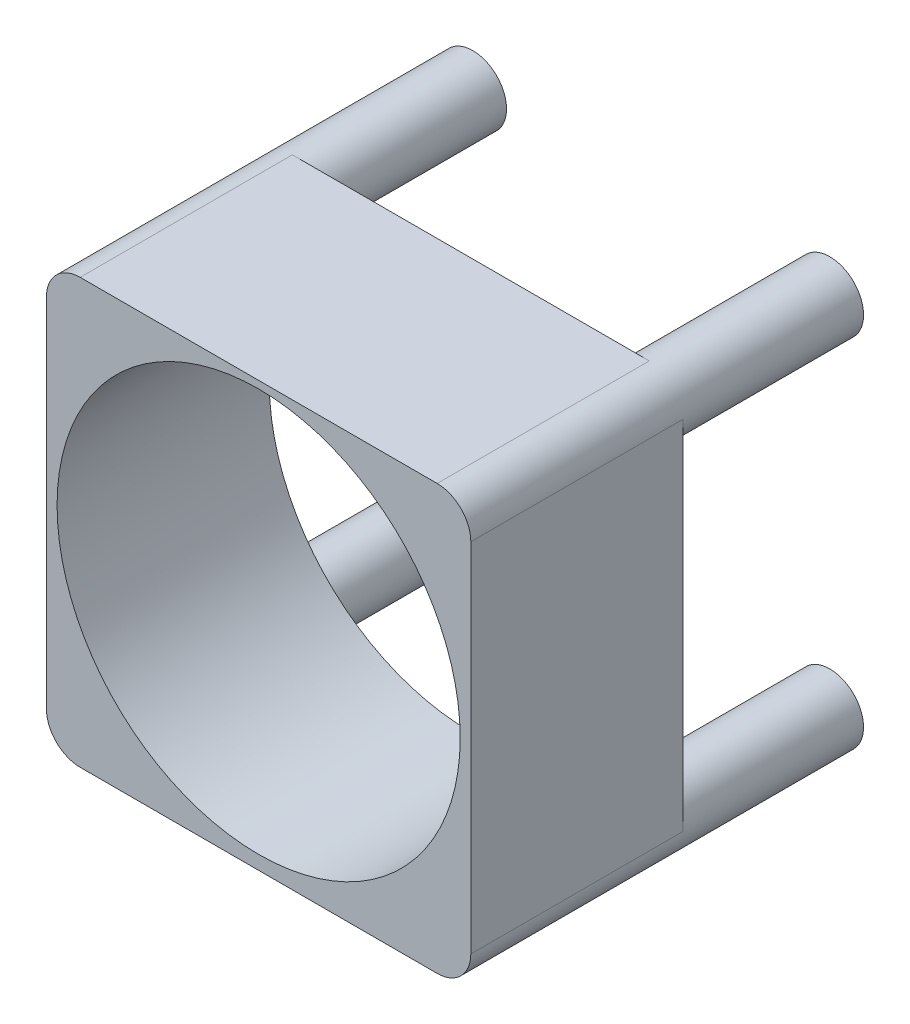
ISO-10303-21;
HEADER;
FILE_DESCRIPTION(('STEP AP214'),'2;1');
FILE_NAME('part.step','',(''),(''),'','','');
FILE_SCHEMA(('AUTOMOTIVE_DESIGN { 1 0 10303 214 1 1 1 1 }'));
ENDSEC;
DATA;
#1=APPLICATION_CONTEXT('core data for automotive mechanical design processes');
#2=APPLICATION_PROTOCOL_DEFINITION('international standard','automotive_design',2000,#1);
#3=PRODUCT_CONTEXT('',#1,'mechanical');
#4=PRODUCT('Part','Part','',(#3));
#5=PRODUCT_RELATED_PRODUCT_CATEGORY('part','',(#4));
#6=PRODUCT_DEFINITION_FORMATION('','',#4);
#7=PRODUCT_DEFINITION_CONTEXT('part definition',#1,'design');
#8=PRODUCT_DEFINITION('design','',#6,#7);
#9=PRODUCT_DEFINITION_SHAPE('','',#8);
#10=(LENGTH_UNIT() NAMED_UNIT(*) SI_UNIT(.MILLI.,.METRE.));
#11=(NAMED_UNIT(*) PLANE_ANGLE_UNIT() SI_UNIT($,.RADIAN.));
#12=(NAMED_UNIT(*) SI_UNIT($,.STERADIAN.) SOLID_ANGLE_UNIT());
#13=UNCERTAINTY_MEASURE_WITH_UNIT(LENGTH_MEASURE(1.E-05),#10,'distance_accuracy_value','');
#14=(GEOMETRIC_REPRESENTATION_CONTEXT(3) GLOBAL_UNCERTAINTY_ASSIGNED_CONTEXT((#13)) GLOBAL_UNIT_ASSIGNED_CONTEXT((#10,
#11,#12)) REPRESENTATION_CONTEXT('',''));
#15=CARTESIAN_POINT('',(0.,0.,0.));
#16=DIRECTION('',(0.,0.,1.));
#17=DIRECTION('',(1.,0.,0.));
#18=AXIS2_PLACEMENT_3D('',#15,#16,#17);
#19=CARTESIAN_POINT('',(3.175,3.175,0.));
#20=DIRECTION('',(0.,0.,1.));
#21=DIRECTION('',(1.,0.,0.));
#22=AXIS2_PLACEMENT_3D('',#19,#20,#21);
#23=PLANE('',#22);
#24=CARTESIAN_POINT('',(20.,20.3026372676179,0.));
#25=DIRECTION('',(0.,0.,1.));
#26=DIRECTION('',(1.,0.,0.));
#27=AXIS2_PLACEMENT_3D('',#24,#25,#26);
#28=CIRCLE('',#27,19.);
#29=CARTESIAN_POINT('',(39.,20.3026372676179,0.));
#30=VERTEX_POINT('',#29);
#31=EDGE_CURVE('E114',#30,#30,#28,.T.);
#32=ORIENTED_EDGE('',*,*,#31,.T.);
#33=EDGE_LOOP('',(#32));
#34=FACE_BOUND('',#33,.T.);
#35=CARTESIAN_POINT('',(36.825,3.17499999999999,0.));
#36=DIRECTION('',(0.,0.,-1.));
#37=DIRECTION('',(-1.,0.,0.));
#38=AXIS2_PLACEMENT_3D('',#35,#36,#37);
#39=CIRCLE('',#38,3.175);
#40=CARTESIAN_POINT('',(36.825,0.,0.));
#41=VERTEX_POINT('',#40);
#42=CARTESIAN_POINT('',(40.,3.17500000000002,0.));
#43=VERTEX_POINT('',#42);
#44=EDGE_CURVE('E96',#41,#43,#39,.T.);
#45=ORIENTED_EDGE('',*,*,#44,.F.);
#46=DIRECTION('',(1.,0.,0.));
#47=VECTOR('',#46,1.);
#48=CARTESIAN_POINT('',(3.17500000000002,0.,0.));
#49=LINE('',#48,#47);
#50=CARTESIAN_POINT('',(3.17500000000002,0.,0.));
#51=VERTEX_POINT('',#50);
#52=EDGE_CURVE('E98',#51,#41,#49,.T.);
#53=ORIENTED_EDGE('',*,*,#52,.F.);
#54=CARTESIAN_POINT('',(3.17499999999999,3.175,0.));
#55=DIRECTION('',(0.,0.,-1.));
#56=DIRECTION('',(1.,0.,0.));
#57=AXIS2_PLACEMENT_3D('',#54,#55,#56);
#58=CIRCLE('',#57,3.175);
#59=CARTESIAN_POINT('',(0.,3.175,0.));
#60=VERTEX_POINT('',#59);
#61=EDGE_CURVE('E190',#60,#51,#58,.T.);
#62=ORIENTED_EDGE('',*,*,#61,.F.);
#63=DIRECTION('',(0.,-1.,0.));
#64=VECTOR('',#63,1.);
#65=CARTESIAN_POINT('',(0.,3.17500000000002,0.));
#66=LINE('',#65,#64);
#67=CARTESIAN_POINT('',(0.,36.825,0.));
#68=VERTEX_POINT('',#67);
#69=EDGE_CURVE('E128',#68,#60,#66,.T.);
#70=ORIENTED_EDGE('',*,*,#69,.F.);
#71=CARTESIAN_POINT('',(3.175,36.825,0.));
#72=DIRECTION('',(0.,0.,-1.));
#73=DIRECTION('',(-1.,0.,0.));
#74=AXIS2_PLACEMENT_3D('',#71,#72,#73);
#75=CIRCLE('',#74,3.175);
#76=CARTESIAN_POINT('',(3.17500000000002,40.,0.));
#77=VERTEX_POINT('',#76);
#78=EDGE_CURVE('E11',#77,#68,#75,.T.);
#79=ORIENTED_EDGE('',*,*,#78,.F.);
#80=DIRECTION('',(-1.,0.,0.));
#81=VECTOR('',#80,1.);
#82=CARTESIAN_POINT('',(3.17500000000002,40.,0.));
#83=LINE('',#82,#81);
#84=CARTESIAN_POINT('',(36.825,40.,0.));
#85=VERTEX_POINT('',#84);
#86=EDGE_CURVE('E134',#85,#77,#83,.T.);
#87=ORIENTED_EDGE('',*,*,#86,.F.);
#88=CARTESIAN_POINT('',(36.825,36.825,0.));
#89=DIRECTION('',(0.,0.,-1.));
#90=DIRECTION('',(1.,0.,0.));
#91=AXIS2_PLACEMENT_3D('',#88,#89,#90);
#92=CIRCLE('',#91,3.175);
#93=CARTESIAN_POINT('',(40.,36.825,0.));
#94=VERTEX_POINT('',#93);
#95=EDGE_CURVE('E164',#94,#85,#92,.T.);
#96=ORIENTED_EDGE('',*,*,#95,.F.);
#97=DIRECTION('',(0.,1.,0.));
#98=VECTOR('',#97,1.);
#99=CARTESIAN_POINT('',(40.,3.17500000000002,0.));
#100=LINE('',#99,#98);
#101=EDGE_CURVE('E101',#43,#94,#100,.T.);
#102=ORIENTED_EDGE('',*,*,#101,.F.);
#103=EDGE_LOOP('',(#45,#53,#62,#70,#79,#87,#96,#102));
#104=FACE_BOUND('',#103,.T.);
#105=ADVANCED_FACE('F29',(#34,#104),#23,.F.);
#106=CARTESIAN_POINT('',(3.175,3.175,20.));
#107=DIRECTION('',(0.,0.,-1.));
#108=DIRECTION('',(-1.,0.,0.));
#109=AXIS2_PLACEMENT_3D('',#106,#107,#108);
#110=CYLINDRICAL_SURFACE('',#109,3.175);
#111=DIRECTION('',(0.,0.,-1.));
#112=VECTOR('',#111,1.);
#113=CARTESIAN_POINT('',(0.,3.17500000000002,20.));
#114=LINE('',#113,#112);
#115=CARTESIAN_POINT('',(0.,3.17500000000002,20.));
#116=VERTEX_POINT('',#115);
#117=EDGE_CURVE('E147',#116,#60,#114,.T.);
#118=ORIENTED_EDGE('',*,*,#117,.T.);
#119=ORIENTED_EDGE('',*,*,#61,.T.);
#120=DIRECTION('',(0.,0.,-1.));
#121=VECTOR('',#120,1.);
#122=CARTESIAN_POINT('',(3.17500000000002,0.,20.));
#123=LINE('',#122,#121);
#124=CARTESIAN_POINT('',(3.17500000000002,0.,20.));
#125=VERTEX_POINT('',#124);
#126=EDGE_CURVE('E38',#125,#51,#123,.T.);
#127=ORIENTED_EDGE('',*,*,#126,.F.);
#128=CARTESIAN_POINT('',(3.175,3.175,20.));
#129=DIRECTION('',(0.,0.,1.));
#130=DIRECTION('',(1.,0.,0.));
#131=AXIS2_PLACEMENT_3D('',#128,#129,#130);
#132=CIRCLE('',#131,3.175);
#133=EDGE_CURVE('E173',#116,#125,#132,.T.);
#134=ORIENTED_EDGE('',*,*,#133,.F.);
#135=EDGE_LOOP('',(#118,#119,#127,#134));
#136=FACE_BOUND('',#135,.T.);
#137=CARTESIAN_POINT('',(3.17499999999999,3.175,-17.018));
#138=DIRECTION('',(0.,0.,-1.));
#139=DIRECTION('',(1.,0.,0.));
#140=AXIS2_PLACEMENT_3D('',#137,#138,#139);
#141=CIRCLE('',#140,3.175);
#142=CARTESIAN_POINT('',(6.34999999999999,3.175,-17.018));
#143=VERTEX_POINT('',#142);
#144=EDGE_CURVE('E191',#143,#143,#141,.T.);
#145=ORIENTED_EDGE('',*,*,#144,.F.);
#146=EDGE_LOOP('',(#145));
#147=FACE_BOUND('',#146,.T.);
#148=ADVANCED_FACE('F31',(#136,#147),#110,.T.);
#149=CARTESIAN_POINT('',(3.17500000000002,0.,20.));
#150=DIRECTION('',(0.,1.,0.));
#151=DIRECTION('',(0.,0.,1.));
#152=AXIS2_PLACEMENT_3D('',#149,#150,#151);
#153=PLANE('',#152);
#154=ORIENTED_EDGE('',*,*,#52,.T.);
#155=DIRECTION('',(0.,0.,-1.));
#156=VECTOR('',#155,1.);
#157=CARTESIAN_POINT('',(36.825,0.,20.));
#158=LINE('',#157,#156);
#159=CARTESIAN_POINT('',(36.825,0.,20.));
#160=VERTEX_POINT('',#159);
#161=EDGE_CURVE('E111',#160,#41,#158,.T.);
#162=ORIENTED_EDGE('',*,*,#161,.F.);
#163=DIRECTION('',(1.,0.,0.));
#164=VECTOR('',#163,1.);
#165=CARTESIAN_POINT('',(3.17500000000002,0.,20.));
#166=LINE('',#165,#164);
#167=EDGE_CURVE('E175',#125,#160,#166,.T.);
#168=ORIENTED_EDGE('',*,*,#167,.F.);
#169=ORIENTED_EDGE('',*,*,#126,.T.);
#170=EDGE_LOOP('',(#154,#162,#168,#169));
#171=FACE_BOUND('',#170,.T.);
#172=ADVANCED_FACE('F110',(#171),#153,.F.);
#173=CARTESIAN_POINT('',(36.825,3.175,20.));
#174=DIRECTION('',(0.,0.,-1.));
#175=DIRECTION('',(-1.,0.,0.));
#176=AXIS2_PLACEMENT_3D('',#173,#174,#175);
#177=CYLINDRICAL_SURFACE('',#176,3.175);
#178=ORIENTED_EDGE('',*,*,#161,.T.);
#179=ORIENTED_EDGE('',*,*,#44,.T.);
#180=DIRECTION('',(0.,0.,-1.));
#181=VECTOR('',#180,1.);
#182=CARTESIAN_POINT('',(40.,3.17500000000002,20.));
#183=LINE('',#182,#181);
#184=CARTESIAN_POINT('',(40.,3.17500000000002,20.));
#185=VERTEX_POINT('',#184);
#186=EDGE_CURVE('E119',#185,#43,#183,.T.);
#187=ORIENTED_EDGE('',*,*,#186,.F.);
#188=CARTESIAN_POINT('',(36.825,3.175,20.));
#189=DIRECTION('',(0.,0.,1.));
#190=DIRECTION('',(1.,0.,0.));
#191=AXIS2_PLACEMENT_3D('',#188,#189,#190);
#192=CIRCLE('',#191,3.175);
#193=EDGE_CURVE('E118',#160,#185,#192,.T.);
#194=ORIENTED_EDGE('',*,*,#193,.F.);
#195=EDGE_LOOP('',(#178,#179,#187,#194));
#196=FACE_BOUND('',#195,.T.);
#197=CARTESIAN_POINT('',(36.825,3.17499999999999,-17.018));
#198=DIRECTION('',(0.,0.,-1.));
#199=DIRECTION('',(-1.,0.,0.));
#200=AXIS2_PLACEMENT_3D('',#197,#198,#199);
#201=CIRCLE('',#200,3.175);
#202=CARTESIAN_POINT('',(33.65,3.17499999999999,-17.018));
#203=VERTEX_POINT('',#202);
#204=EDGE_CURVE('E106',#203,#203,#201,.T.);
#205=ORIENTED_EDGE('',*,*,#204,.F.);
#206=EDGE_LOOP('',(#205));
#207=FACE_BOUND('',#206,.T.);
#208=ADVANCED_FACE('F116',(#196,#207),#177,.T.);
#209=CARTESIAN_POINT('',(40.,3.17500000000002,20.));
#210=DIRECTION('',(-1.,0.,0.));
#211=DIRECTION('',(0.,0.,1.));
#212=AXIS2_PLACEMENT_3D('',#209,#210,#211);
#213=PLANE('',#212);
#214=ORIENTED_EDGE('',*,*,#101,.T.);
#215=DIRECTION('',(0.,0.,-1.));
#216=VECTOR('',#215,1.);
#217=CARTESIAN_POINT('',(40.,36.825,20.));
#218=LINE('',#217,#216);
#219=CARTESIAN_POINT('',(40.,36.825,20.));
#220=VERTEX_POINT('',#219);
#221=EDGE_CURVE('E122',#220,#94,#218,.T.);
#222=ORIENTED_EDGE('',*,*,#221,.F.);
#223=DIRECTION('',(0.,1.,0.));
#224=VECTOR('',#223,1.);
#225=CARTESIAN_POINT('',(40.,3.17500000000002,20.));
#226=LINE('',#225,#224);
#227=EDGE_CURVE('E169',#185,#220,#226,.T.);
#228=ORIENTED_EDGE('',*,*,#227,.F.);
#229=ORIENTED_EDGE('',*,*,#186,.T.);
#230=EDGE_LOOP('',(#214,#222,#228,#229));
#231=FACE_BOUND('',#230,.T.);
#232=ADVANCED_FACE('F168',(#231),#213,.F.);
#233=CARTESIAN_POINT('',(36.825,36.825,20.));
#234=DIRECTION('',(0.,0.,-1.));
#235=DIRECTION('',(-1.,0.,0.));
#236=AXIS2_PLACEMENT_3D('',#233,#234,#235);
#237=CYLINDRICAL_SURFACE('',#236,3.175);
#238=ORIENTED_EDGE('',*,*,#221,.T.);
#239=ORIENTED_EDGE('',*,*,#95,.T.);
#240=DIRECTION('',(0.,0.,-1.));
#241=VECTOR('',#240,1.);
#242=CARTESIAN_POINT('',(36.825,40.,20.));
#243=LINE('',#242,#241);
#244=CARTESIAN_POINT('',(36.825,40.,20.));
#245=VERTEX_POINT('',#244);
#246=EDGE_CURVE('E140',#245,#85,#243,.T.);
#247=ORIENTED_EDGE('',*,*,#246,.F.);
#248=CARTESIAN_POINT('',(36.825,36.825,20.));
#249=DIRECTION('',(0.,0.,1.));
#250=DIRECTION('',(1.,0.,0.));
#251=AXIS2_PLACEMENT_3D('',#248,#249,#250);
#252=CIRCLE('',#251,3.175);
#253=EDGE_CURVE('E165',#220,#245,#252,.T.);
#254=ORIENTED_EDGE('',*,*,#253,.F.);
#255=EDGE_LOOP('',(#238,#239,#247,#254));
#256=FACE_BOUND('',#255,.T.);
#257=CARTESIAN_POINT('',(36.825,36.825,-17.018));
#258=DIRECTION('',(0.,0.,-1.));
#259=DIRECTION('',(1.,0.,0.));
#260=AXIS2_PLACEMENT_3D('',#257,#258,#259);
#261=CIRCLE('',#260,3.175);
#262=CARTESIAN_POINT('',(40.,36.825,-17.018));
#263=VERTEX_POINT('',#262);
#264=EDGE_CURVE('E199',#263,#263,#261,.T.);
#265=ORIENTED_EDGE('',*,*,#264,.F.);
#266=EDGE_LOOP('',(#265));
#267=FACE_BOUND('',#266,.T.);
#268=ADVANCED_FACE('F161',(#256,#267),#237,.T.);
#269=CARTESIAN_POINT('',(3.17500000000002,40.,20.));
#270=DIRECTION('',(0.,-1.,0.));
#271=DIRECTION('',(0.,0.,-1.));
#272=AXIS2_PLACEMENT_3D('',#269,#270,#271);
#273=PLANE('',#272);
#274=ORIENTED_EDGE('',*,*,#86,.T.);
#275=DIRECTION('',(0.,0.,-1.));
#276=VECTOR('',#275,1.);
#277=CARTESIAN_POINT('',(3.17500000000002,40.,20.));
#278=LINE('',#277,#276);
#279=CARTESIAN_POINT('',(3.17500000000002,40.,20.));
#280=VERTEX_POINT('',#279);
#281=EDGE_CURVE('E138',#280,#77,#278,.T.);
#282=ORIENTED_EDGE('',*,*,#281,.F.);
#283=DIRECTION('',(-1.,0.,0.));
#284=VECTOR('',#283,1.);
#285=CARTESIAN_POINT('',(3.17500000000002,40.,20.));
#286=LINE('',#285,#284);
#287=EDGE_CURVE('E180',#245,#280,#286,.T.);
#288=ORIENTED_EDGE('',*,*,#287,.F.);
#289=ORIENTED_EDGE('',*,*,#246,.T.);
#290=EDGE_LOOP('',(#274,#282,#288,#289));
#291=FACE_BOUND('',#290,.T.);
#292=ADVANCED_FACE('F184',(#291),#273,.F.);
#293=CARTESIAN_POINT('',(3.175,36.825,20.));
#294=DIRECTION('',(0.,0.,-1.));
#295=DIRECTION('',(-1.,0.,0.));
#296=AXIS2_PLACEMENT_3D('',#293,#294,#295);
#297=CYLINDRICAL_SURFACE('',#296,3.175);
#298=ORIENTED_EDGE('',*,*,#281,.T.);
#299=ORIENTED_EDGE('',*,*,#78,.T.);
#300=DIRECTION('',(0.,0.,-1.));
#301=VECTOR('',#300,1.);
#302=CARTESIAN_POINT('',(0.,36.825,20.));
#303=LINE('',#302,#301);
#304=CARTESIAN_POINT('',(0.,36.825,20.));
#305=VERTEX_POINT('',#304);
#306=EDGE_CURVE('E141',#305,#68,#303,.T.);
#307=ORIENTED_EDGE('',*,*,#306,.F.);
#308=CARTESIAN_POINT('',(3.175,36.825,20.));
#309=DIRECTION('',(0.,0.,1.));
#310=DIRECTION('',(1.,0.,0.));
#311=AXIS2_PLACEMENT_3D('',#308,#309,#310);
#312=CIRCLE('',#311,3.175);
#313=EDGE_CURVE('E51',#280,#305,#312,.T.);
#314=ORIENTED_EDGE('',*,*,#313,.F.);
#315=EDGE_LOOP('',(#298,#299,#307,#314));
#316=FACE_BOUND('',#315,.T.);
#317=CARTESIAN_POINT('',(3.175,36.825,-17.018));
#318=DIRECTION('',(0.,0.,-1.));
#319=DIRECTION('',(-1.,0.,0.));
#320=AXIS2_PLACEMENT_3D('',#317,#318,#319);
#321=CIRCLE('',#320,3.175);
#322=CARTESIAN_POINT('',(0.,36.825,-17.018));
#323=VERTEX_POINT('',#322);
#324=EDGE_CURVE('E202',#323,#323,#321,.T.);
#325=ORIENTED_EDGE('',*,*,#324,.F.);
#326=EDGE_LOOP('',(#325));
#327=FACE_BOUND('',#326,.T.);
#328=ADVANCED_FACE('F186',(#316,#327),#297,.T.);
#329=CARTESIAN_POINT('',(0.,3.17500000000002,20.));
#330=DIRECTION('',(1.,0.,0.));
#331=DIRECTION('',(0.,0.,-1.));
#332=AXIS2_PLACEMENT_3D('',#329,#330,#331);
#333=PLANE('',#332);
#334=ORIENTED_EDGE('',*,*,#69,.T.);
#335=ORIENTED_EDGE('',*,*,#117,.F.);
#336=DIRECTION('',(0.,-1.,0.));
#337=VECTOR('',#336,1.);
#338=CARTESIAN_POINT('',(0.,3.17500000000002,20.));
#339=LINE('',#338,#337);
#340=EDGE_CURVE('E46',#305,#116,#339,.T.);
#341=ORIENTED_EDGE('',*,*,#340,.F.);
#342=ORIENTED_EDGE('',*,*,#306,.T.);
#343=EDGE_LOOP('',(#334,#335,#341,#342));
#344=FACE_BOUND('',#343,.T.);
#345=ADVANCED_FACE('F188',(#344),#333,.F.);
#346=CARTESIAN_POINT('',(3.175,3.175,20.));
#347=DIRECTION('',(0.,0.,1.));
#348=DIRECTION('',(1.,0.,0.));
#349=AXIS2_PLACEMENT_3D('',#346,#347,#348);
#350=PLANE('',#349);
#351=CARTESIAN_POINT('',(20.,20.3026372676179,20.));
#352=DIRECTION('',(0.,0.,1.));
#353=DIRECTION('',(1.,0.,0.));
#354=AXIS2_PLACEMENT_3D('',#351,#352,#353);
#355=CIRCLE('',#354,19.);
#356=CARTESIAN_POINT('',(39.,20.3026372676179,20.));
#357=VERTEX_POINT('',#356);
#358=EDGE_CURVE('E205',#357,#357,#355,.T.);
#359=ORIENTED_EDGE('',*,*,#358,.F.);
#360=EDGE_LOOP('',(#359));
#361=FACE_BOUND('',#360,.T.);
#362=ORIENTED_EDGE('',*,*,#133,.T.);
#363=ORIENTED_EDGE('',*,*,#167,.T.);
#364=ORIENTED_EDGE('',*,*,#193,.T.);
#365=ORIENTED_EDGE('',*,*,#227,.T.);
#366=ORIENTED_EDGE('',*,*,#253,.T.);
#367=ORIENTED_EDGE('',*,*,#287,.T.);
#368=ORIENTED_EDGE('',*,*,#313,.T.);
#369=ORIENTED_EDGE('',*,*,#340,.T.);
#370=EDGE_LOOP('',(#362,#363,#364,#365,#366,#367,#368,#369));
#371=FACE_BOUND('',#370,.T.);
#372=ADVANCED_FACE('F182',(#361,#371),#350,.T.);
#373=CARTESIAN_POINT('',(20.,20.3026372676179,0.));
#374=DIRECTION('',(0.,0.,1.));
#375=DIRECTION('',(1.,0.,0.));
#376=AXIS2_PLACEMENT_3D('',#373,#374,#375);
#377=CYLINDRICAL_SURFACE('',#376,19.);
#378=ORIENTED_EDGE('',*,*,#31,.F.);
#379=EDGE_LOOP('',(#378));
#380=FACE_BOUND('',#379,.T.);
#381=ORIENTED_EDGE('',*,*,#358,.T.);
#382=EDGE_LOOP('',(#381));
#383=FACE_BOUND('',#382,.T.);
#384=ADVANCED_FACE('F211',(#380,#383),#377,.F.);
#385=CARTESIAN_POINT('',(3.175,36.825,-17.018));
#386=DIRECTION('',(0.,0.,-1.));
#387=DIRECTION('',(-1.,0.,0.));
#388=AXIS2_PLACEMENT_3D('',#385,#386,#387);
#389=PLANE('',#388);
#390=ORIENTED_EDGE('',*,*,#324,.T.);
#391=EDGE_LOOP('',(#390));
#392=FACE_BOUND('',#391,.T.);
#393=ADVANCED_FACE('F214',(#392),#389,.T.);
#394=CARTESIAN_POINT('',(36.825,36.825,-17.018));
#395=DIRECTION('',(0.,0.,1.));
#396=DIRECTION('',(1.,0.,0.));
#397=AXIS2_PLACEMENT_3D('',#394,#395,#396);
#398=PLANE('',#397);
#399=ORIENTED_EDGE('',*,*,#264,.T.);
#400=EDGE_LOOP('',(#399));
#401=FACE_BOUND('',#400,.T.);
#402=ADVANCED_FACE('F232',(#401),#398,.F.);
#403=CARTESIAN_POINT('',(3.17499999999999,3.175,-17.018));
#404=DIRECTION('',(0.,0.,1.));
#405=DIRECTION('',(1.,0.,0.));
#406=AXIS2_PLACEMENT_3D('',#403,#404,#405);
#407=PLANE('',#406);
#408=ORIENTED_EDGE('',*,*,#144,.T.);
#409=EDGE_LOOP('',(#408));
#410=FACE_BOUND('',#409,.T.);
#411=ADVANCED_FACE('F236',(#410),#407,.F.);
#412=CARTESIAN_POINT('',(36.825,3.17499999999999,-17.018));
#413=DIRECTION('',(0.,0.,-1.));
#414=DIRECTION('',(-1.,0.,0.));
#415=AXIS2_PLACEMENT_3D('',#412,#413,#414);
#416=PLANE('',#415);
#417=ORIENTED_EDGE('',*,*,#204,.T.);
#418=EDGE_LOOP('',(#417));
#419=FACE_BOUND('',#418,.T.);
#420=ADVANCED_FACE('F240',(#419),#416,.T.);
#421=CLOSED_SHELL('',(#105,#148,#172,#208,#232,#268,#292,#328,#345,#372,#384,#393,#402,#411,#420));
#422=MANIFOLD_SOLID_BREP('B2',#421);
#423=ADVANCED_BREP_SHAPE_REPRESENTATION('',(#18,#422),#14);
#424=SHAPE_DEFINITION_REPRESENTATION(#9,#423);
ENDSEC;
END-ISO-10303-21;
